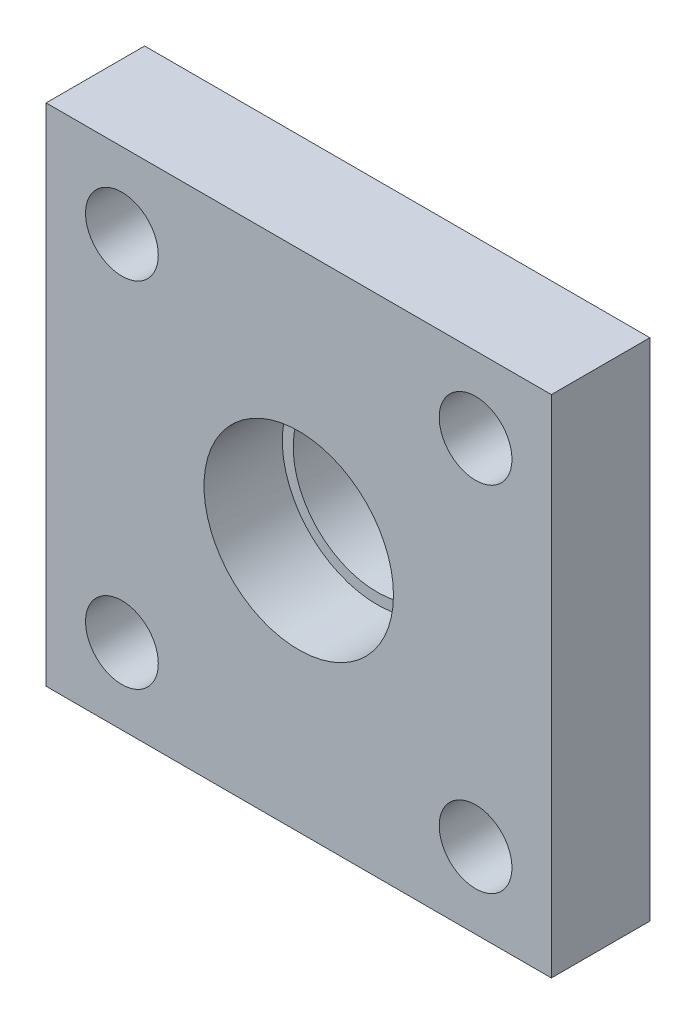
from build123d import *

# Parameters (mm, degrees)
SKETCH52_W         = 12.7
SKETCH52_H         = 12.7
EXTRUDE1_DEPTH     = 4.572
SKETCH50_W         = 25.4
SKETCH50_H         = 25.4
EXTRUDE2_DEPTH     = 4.953
SKETCH49_R         = 1.8288
CUT_EXTRUDE2_DEPTH = 41.50444949
CUT_EXTRUDE3_START = -4.572
SKETCH53_R         = 4.2164
CUT_EXTRUDE3_DEPTH = 46.07644949
CUT_EXTRUDE4_START = 4.953
SKETCH51_R         = 4.7625
CUT_EXTRUDE4_DEPTH = 3.937


with BuildPart() as part:
    # Sketch52 → Extrude1 (new body)
    with BuildSketch(Plane.XY):
        with Locations((24.6888, 2.0701)):
            Rectangle(SKETCH52_W, SKETCH52_H)
    extrude(amount=-EXTRUDE1_DEPTH)

    # Sketch50 → Extrude2 (add)
    with BuildSketch(Plane.XY):
        with Locations((24.6888, 2.0701)):
            Rectangle(SKETCH50_W, SKETCH50_H)
    extrude(amount=EXTRUDE2_DEPTH)

    # Sketch49 → Cut-Extrude2 (cut, through all)
    with BuildSketch(Plane.XY):
        with Locations((15.7988, 10.9601)):
            Circle(SKETCH49_R)
        with Locations((33.5788, 10.9601)):
            Circle(SKETCH49_R)
        with Locations((33.5788, -6.8199)):
            Circle(SKETCH49_R)
        with Locations((15.7988, -6.8199)):
            Circle(SKETCH49_R)
    extrude(amount=CUT_EXTRUDE2_DEPTH, mode=Mode.SUBTRACT)

    # Sketch53 → Cut-Extrude3 (cut, through all)
    with BuildSketch(Plane.XY.offset(CUT_EXTRUDE3_START)):
        with Locations((24.6888, 2.0701)):
            Circle(SKETCH53_R)
    extrude(amount=CUT_EXTRUDE3_DEPTH, mode=Mode.SUBTRACT)

    # Sketch51 → Cut-Extrude4 (cut)
    with BuildSketch(Plane.XY.offset(CUT_EXTRUDE4_START)):
        with Locations((24.6888, 2.0701)):
            Circle(SKETCH51_R)
    extrude(amount=-CUT_EXTRUDE4_DEPTH, mode=Mode.SUBTRACT)


solid = part.part
